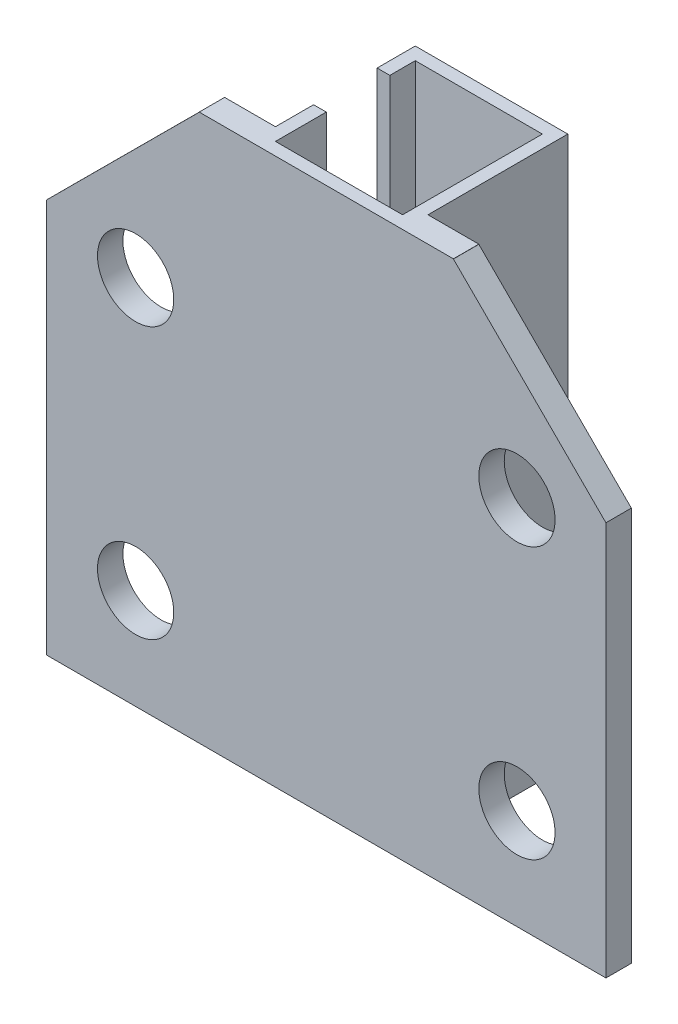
ISO-10303-21;
HEADER;
FILE_DESCRIPTION(('STEP AP214'),'2;1');
FILE_NAME('part.step','',(''),(''),'','','');
FILE_SCHEMA(('AUTOMOTIVE_DESIGN { 1 0 10303 214 1 1 1 1 }'));
ENDSEC;
DATA;
#1=APPLICATION_CONTEXT('core data for automotive mechanical design processes');
#2=APPLICATION_PROTOCOL_DEFINITION('international standard','automotive_design',2000,#1);
#3=PRODUCT_CONTEXT('',#1,'mechanical');
#4=PRODUCT('Part','Part','',(#3));
#5=PRODUCT_RELATED_PRODUCT_CATEGORY('part','',(#4));
#6=PRODUCT_DEFINITION_FORMATION('','',#4);
#7=PRODUCT_DEFINITION_CONTEXT('part definition',#1,'design');
#8=PRODUCT_DEFINITION('design','',#6,#7);
#9=PRODUCT_DEFINITION_SHAPE('','',#8);
#10=(LENGTH_UNIT() NAMED_UNIT(*) SI_UNIT(.MILLI.,.METRE.));
#11=(NAMED_UNIT(*) PLANE_ANGLE_UNIT() SI_UNIT($,.RADIAN.));
#12=(NAMED_UNIT(*) SI_UNIT($,.STERADIAN.) SOLID_ANGLE_UNIT());
#13=UNCERTAINTY_MEASURE_WITH_UNIT(LENGTH_MEASURE(1.E-05),#10,'distance_accuracy_value','');
#14=(GEOMETRIC_REPRESENTATION_CONTEXT(3) GLOBAL_UNCERTAINTY_ASSIGNED_CONTEXT((#13)) GLOBAL_UNIT_ASSIGNED_CONTEXT((#10,
#11,#12)) REPRESENTATION_CONTEXT('',''));
#15=CARTESIAN_POINT('',(0.,0.,0.));
#16=DIRECTION('',(0.,0.,1.));
#17=DIRECTION('',(1.,0.,0.));
#18=AXIS2_PLACEMENT_3D('',#15,#16,#17);
#19=CARTESIAN_POINT('',(-11.,21.5,-2.94888178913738));
#20=DIRECTION('',(0.,1.,0.));
#21=DIRECTION('',(0.,0.,1.));
#22=AXIS2_PLACEMENT_3D('',#19,#20,#21);
#23=PLANE('',#22);
#24=DIRECTION('',(-1.,0.,0.));
#25=VECTOR('',#24,1.);
#26=CARTESIAN_POINT('',(11.001,21.5,-5.44888178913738));
#27=LINE('',#26,#25);
#28=CARTESIAN_POINT('',(-2.5,21.5,-5.44888178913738));
#29=VERTEX_POINT('',#28);
#30=CARTESIAN_POINT('',(-3.,21.5,-5.44888178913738));
#31=VERTEX_POINT('',#30);
#32=EDGE_CURVE('E502',#29,#31,#27,.T.);
#33=ORIENTED_EDGE('',*,*,#32,.T.);
#34=DIRECTION('',(0.,0.,1.));
#35=VECTOR('',#34,1.);
#36=CARTESIAN_POINT('',(-3.,21.5,-3.94888178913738));
#37=LINE('',#36,#35);
#38=CARTESIAN_POINT('',(-3.,21.5,-3.94888178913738));
#39=VERTEX_POINT('',#38);
#40=EDGE_CURVE('E558',#31,#39,#37,.T.);
#41=ORIENTED_EDGE('',*,*,#40,.T.);
#42=DIRECTION('',(-1.,0.,0.));
#43=VECTOR('',#42,1.);
#44=CARTESIAN_POINT('',(-11.,21.5,-3.94888178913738));
#45=LINE('',#44,#43);
#46=CARTESIAN_POINT('',(-4.99966483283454,21.5,-3.94888178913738));
#47=VERTEX_POINT('',#46);
#48=EDGE_CURVE('E560',#39,#47,#45,.T.);
#49=ORIENTED_EDGE('',*,*,#48,.T.);
#50=DIRECTION('',(0.,0.,1.));
#51=VECTOR('',#50,1.);
#52=CARTESIAN_POINT('',(-4.99966483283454,21.5,-2.94888178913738));
#53=LINE('',#52,#51);
#54=CARTESIAN_POINT('',(-4.99966483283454,21.5,-2.94888178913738));
#55=VERTEX_POINT('',#54);
#56=EDGE_CURVE('E663',#47,#55,#53,.T.);
#57=ORIENTED_EDGE('',*,*,#56,.T.);
#58=DIRECTION('',(1.,0.,0.));
#59=VECTOR('',#58,1.);
#60=CARTESIAN_POINT('',(-11.,21.5,-2.94888178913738));
#61=LINE('',#60,#59);
#62=CARTESIAN_POINT('',(4.99966483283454,21.5,-2.94888178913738));
#63=VERTEX_POINT('',#62);
#64=EDGE_CURVE('E550',#55,#63,#61,.T.);
#65=ORIENTED_EDGE('',*,*,#64,.T.);
#66=DIRECTION('',(0.,0.,1.));
#67=VECTOR('',#66,1.);
#68=CARTESIAN_POINT('',(4.99966483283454,21.5,-2.94888178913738));
#69=LINE('',#68,#67);
#70=CARTESIAN_POINT('',(4.99966483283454,21.5,-3.94888178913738));
#71=VERTEX_POINT('',#70);
#72=EDGE_CURVE('E613',#71,#63,#69,.T.);
#73=ORIENTED_EDGE('',*,*,#72,.F.);
#74=DIRECTION('',(-1.,0.,0.));
#75=VECTOR('',#74,1.);
#76=CARTESIAN_POINT('',(11.,21.5,-3.94888178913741));
#77=LINE('',#76,#75);
#78=CARTESIAN_POINT('',(3.,21.5,-3.94888178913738));
#79=VERTEX_POINT('',#78);
#80=EDGE_CURVE('E552',#71,#79,#77,.T.);
#81=ORIENTED_EDGE('',*,*,#80,.T.);
#82=DIRECTION('',(0.,0.,-1.));
#83=VECTOR('',#82,1.);
#84=CARTESIAN_POINT('',(3.,21.5,-3.94888178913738));
#85=LINE('',#84,#83);
#86=CARTESIAN_POINT('',(3.,21.5,-9.44888178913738));
#87=VERTEX_POINT('',#86);
#88=EDGE_CURVE('E554',#79,#87,#85,.T.);
#89=ORIENTED_EDGE('',*,*,#88,.T.);
#90=DIRECTION('',(-1.,0.,0.));
#91=VECTOR('',#90,1.);
#92=CARTESIAN_POINT('',(3.,21.5,-9.44888178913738));
#93=LINE('',#92,#91);
#94=CARTESIAN_POINT('',(-3.,21.5,-9.44888178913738));
#95=VERTEX_POINT('',#94);
#96=EDGE_CURVE('E556',#87,#95,#93,.T.);
#97=ORIENTED_EDGE('',*,*,#96,.T.);
#98=CARTESIAN_POINT('',(-3.,21.5,-7.94888178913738));
#99=VERTEX_POINT('',#98);
#100=EDGE_CURVE('E501',#95,#99,#37,.T.);
#101=ORIENTED_EDGE('',*,*,#100,.T.);
#102=DIRECTION('',(1.,0.,0.));
#103=VECTOR('',#102,1.);
#104=CARTESIAN_POINT('',(11.001,21.5,-7.94888178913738));
#105=LINE('',#104,#103);
#106=CARTESIAN_POINT('',(-2.5,21.5,-7.94888178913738));
#107=VERTEX_POINT('',#106);
#108=EDGE_CURVE('E486',#99,#107,#105,.T.);
#109=ORIENTED_EDGE('',*,*,#108,.T.);
#110=DIRECTION('',(0.,0.,1.));
#111=VECTOR('',#110,1.);
#112=CARTESIAN_POINT('',(-2.5,21.5,-8.94888178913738));
#113=LINE('',#112,#111);
#114=CARTESIAN_POINT('',(-2.5,21.5,-8.94888178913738));
#115=VERTEX_POINT('',#114);
#116=EDGE_CURVE('E499',#115,#107,#113,.T.);
#117=ORIENTED_EDGE('',*,*,#116,.F.);
#118=DIRECTION('',(-1.,0.,0.));
#119=VECTOR('',#118,1.);
#120=CARTESIAN_POINT('',(-2.5,21.5,-8.94888178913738));
#121=LINE('',#120,#119);
#122=CARTESIAN_POINT('',(2.5,21.5,-8.94888178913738));
#123=VERTEX_POINT('',#122);
#124=EDGE_CURVE('E520',#123,#115,#121,.T.);
#125=ORIENTED_EDGE('',*,*,#124,.F.);
#126=DIRECTION('',(0.,0.,-1.));
#127=VECTOR('',#126,1.);
#128=CARTESIAN_POINT('',(2.5,21.5,-8.94888178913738));
#129=LINE('',#128,#127);
#130=CARTESIAN_POINT('',(2.5,21.5,-3.44888178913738));
#131=VERTEX_POINT('',#130);
#132=EDGE_CURVE('E512',#131,#123,#129,.T.);
#133=ORIENTED_EDGE('',*,*,#132,.F.);
#134=DIRECTION('',(1.,0.,0.));
#135=VECTOR('',#134,1.);
#136=CARTESIAN_POINT('',(-2.5,21.5,-3.44888178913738));
#137=LINE('',#136,#135);
#138=CARTESIAN_POINT('',(-2.5,21.5,-3.44888178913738));
#139=VERTEX_POINT('',#138);
#140=EDGE_CURVE('E509',#139,#131,#137,.T.);
#141=ORIENTED_EDGE('',*,*,#140,.F.);
#142=EDGE_CURVE('E510',#29,#139,#113,.T.);
#143=ORIENTED_EDGE('',*,*,#142,.F.);
#144=EDGE_LOOP('',(#33,#41,#49,#57,#65,#73,#81,#89,#97,#101,#109,#117,#125,#133,#141,#143));
#145=FACE_BOUND('',#144,.T.);
#146=ADVANCED_FACE('F349',(#145),#23,.T.);
#147=CARTESIAN_POINT('',(-11.,21.5,-2.94888178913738));
#148=DIRECTION('',(0.,0.,-1.));
#149=DIRECTION('',(-1.,0.,0.));
#150=AXIS2_PLACEMENT_3D('',#147,#148,#149);
#151=PLANE('',#150);
#152=CARTESIAN_POINT('',(-7.50000000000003,14.6078928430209,-2.94888178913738));
#153=DIRECTION('',(0.,0.,-1.));
#154=DIRECTION('',(-1.,0.,0.));
#155=AXIS2_PLACEMENT_3D('',#152,#153,#154);
#156=CIRCLE('',#155,1.5);
#157=CARTESIAN_POINT('',(-9.00000000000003,14.6078928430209,-2.94888178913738));
#158=VERTEX_POINT('',#157);
#159=EDGE_CURVE('E843',#158,#158,#156,.T.);
#160=ORIENTED_EDGE('',*,*,#159,.T.);
#161=EDGE_LOOP('',(#160));
#162=FACE_BOUND('',#161,.T.);
#163=CARTESIAN_POINT('',(7.5,14.6078928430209,-2.94888178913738));
#164=DIRECTION('',(0.,0.,-1.));
#165=DIRECTION('',(-1.,0.,0.));
#166=AXIS2_PLACEMENT_3D('',#163,#164,#165);
#167=CIRCLE('',#166,1.5);
#168=CARTESIAN_POINT('',(6.,14.6078928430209,-2.94888178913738));
#169=VERTEX_POINT('',#168);
#170=EDGE_CURVE('E853',#169,#169,#167,.T.);
#171=ORIENTED_EDGE('',*,*,#170,.T.);
#172=EDGE_LOOP('',(#171));
#173=FACE_BOUND('',#172,.T.);
#174=CARTESIAN_POINT('',(-7.5,3.94889284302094,-2.94888178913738));
#175=DIRECTION('',(0.,0.,-1.));
#176=DIRECTION('',(-1.,0.,0.));
#177=AXIS2_PLACEMENT_3D('',#174,#175,#176);
#178=CIRCLE('',#177,1.5);
#179=CARTESIAN_POINT('',(-9.,3.94889284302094,-2.94888178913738));
#180=VERTEX_POINT('',#179);
#181=EDGE_CURVE('E859',#180,#180,#178,.T.);
#182=ORIENTED_EDGE('',*,*,#181,.T.);
#183=EDGE_LOOP('',(#182));
#184=FACE_BOUND('',#183,.T.);
#185=CARTESIAN_POINT('',(7.5,3.94889284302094,-2.94888178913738));
#186=DIRECTION('',(0.,0.,-1.));
#187=DIRECTION('',(-1.,0.,0.));
#188=AXIS2_PLACEMENT_3D('',#185,#186,#187);
#189=CIRCLE('',#188,1.5);
#190=CARTESIAN_POINT('',(6.,3.94889284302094,-2.94888178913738));
#191=VERTEX_POINT('',#190);
#192=EDGE_CURVE('E648',#191,#191,#189,.T.);
#193=ORIENTED_EDGE('',*,*,#192,.T.);
#194=EDGE_LOOP('',(#193));
#195=FACE_BOUND('',#194,.T.);
#196=DIRECTION('',(0.0594599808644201,0.998230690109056,0.));
#197=VECTOR('',#196,1.);
#198=CARTESIAN_POINT('',(-5.,21.4943731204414,-2.94888178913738));
#199=LINE('',#198,#197);
#200=CARTESIAN_POINT('',(-5.,21.4943731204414,-2.94888178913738));
#201=VERTEX_POINT('',#200);
#202=EDGE_CURVE('E670',#201,#55,#199,.T.);
#203=ORIENTED_EDGE('',*,*,#202,.F.);
#204=DIRECTION('',(0.707911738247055,0.706300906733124,0.));
#205=VECTOR('',#204,1.);
#206=CARTESIAN_POINT('',(-5.,21.4943731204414,-2.94888178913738));
#207=LINE('',#206,#205);
#208=CARTESIAN_POINT('',(-11.,15.508025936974,-2.94888178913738));
#209=VERTEX_POINT('',#208);
#210=EDGE_CURVE('E881',#209,#201,#207,.T.);
#211=ORIENTED_EDGE('',*,*,#210,.F.);
#212=DIRECTION('',(0.,-1.,0.));
#213=VECTOR('',#212,1.);
#214=CARTESIAN_POINT('',(-11.,21.5,-2.94888178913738));
#215=LINE('',#214,#213);
#216=CARTESIAN_POINT('',(-11.,0.,-2.94888178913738));
#217=VERTEX_POINT('',#216);
#218=EDGE_CURVE('E581',#209,#217,#215,.T.);
#219=ORIENTED_EDGE('',*,*,#218,.T.);
#220=DIRECTION('',(1.,0.,0.));
#221=VECTOR('',#220,1.);
#222=CARTESIAN_POINT('',(-11.,0.,-2.94888178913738));
#223=LINE('',#222,#221);
#224=CARTESIAN_POINT('',(11.,0.,-2.94888178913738));
#225=VERTEX_POINT('',#224);
#226=EDGE_CURVE('E530',#217,#225,#223,.T.);
#227=ORIENTED_EDGE('',*,*,#226,.T.);
#228=DIRECTION('',(0.,-1.,0.));
#229=VECTOR('',#228,1.);
#230=CARTESIAN_POINT('',(11.,21.5,-2.94888178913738));
#231=LINE('',#230,#229);
#232=CARTESIAN_POINT('',(11.,15.508025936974,-2.94888178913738));
#233=VERTEX_POINT('',#232);
#234=EDGE_CURVE('E579',#233,#225,#231,.T.);
#235=ORIENTED_EDGE('',*,*,#234,.F.);
#236=DIRECTION('',(-0.707911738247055,0.706300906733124,0.));
#237=VECTOR('',#236,1.);
#238=CARTESIAN_POINT('',(5.,21.4943731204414,-2.94888178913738));
#239=LINE('',#238,#237);
#240=CARTESIAN_POINT('',(5.,21.4943731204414,-2.94888178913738));
#241=VERTEX_POINT('',#240);
#242=EDGE_CURVE('E673',#233,#241,#239,.T.);
#243=ORIENTED_EDGE('',*,*,#242,.T.);
#244=DIRECTION('',(-0.0594599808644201,0.998230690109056,0.));
#245=VECTOR('',#244,1.);
#246=CARTESIAN_POINT('',(5.,21.4943731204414,-2.94888178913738));
#247=LINE('',#246,#245);
#248=EDGE_CURVE('E672',#241,#63,#247,.T.);
#249=ORIENTED_EDGE('',*,*,#248,.T.);
#250=ORIENTED_EDGE('',*,*,#64,.F.);
#251=EDGE_LOOP('',(#203,#211,#219,#227,#235,#243,#249,#250));
#252=FACE_BOUND('',#251,.T.);
#253=ADVANCED_FACE('F351',(#162,#173,#184,#195,#252),#151,.F.);
#254=CARTESIAN_POINT('',(-11.,21.5,-3.94888178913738));
#255=DIRECTION('',(0.,0.,1.));
#256=DIRECTION('',(1.,0.,0.));
#257=AXIS2_PLACEMENT_3D('',#254,#255,#256);
#258=PLANE('',#257);
#259=CARTESIAN_POINT('',(-7.50000000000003,14.6078928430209,-3.94888178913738));
#260=DIRECTION('',(0.,0.,-1.));
#261=DIRECTION('',(-1.,0.,0.));
#262=AXIS2_PLACEMENT_3D('',#259,#260,#261);
#263=CIRCLE('',#262,1.5);
#264=CARTESIAN_POINT('',(-9.00000000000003,14.6078928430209,-3.94888178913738));
#265=VERTEX_POINT('',#264);
#266=EDGE_CURVE('E846',#265,#265,#263,.T.);
#267=ORIENTED_EDGE('',*,*,#266,.F.);
#268=EDGE_LOOP('',(#267));
#269=FACE_BOUND('',#268,.T.);
#270=CARTESIAN_POINT('',(-7.5,3.94889284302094,-3.94888178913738));
#271=DIRECTION('',(0.,0.,-1.));
#272=DIRECTION('',(-1.,0.,0.));
#273=AXIS2_PLACEMENT_3D('',#270,#271,#272);
#274=CIRCLE('',#273,1.5);
#275=CARTESIAN_POINT('',(-9.,3.94889284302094,-3.94888178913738));
#276=VERTEX_POINT('',#275);
#277=EDGE_CURVE('E856',#276,#276,#274,.T.);
#278=ORIENTED_EDGE('',*,*,#277,.F.);
#279=EDGE_LOOP('',(#278));
#280=FACE_BOUND('',#279,.T.);
#281=DIRECTION('',(0.0594599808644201,0.998230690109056,0.));
#282=VECTOR('',#281,1.);
#283=CARTESIAN_POINT('',(-5.,21.4943731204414,-3.94888178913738));
#284=LINE('',#283,#282);
#285=CARTESIAN_POINT('',(-5.,21.4943731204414,-3.94888178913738));
#286=VERTEX_POINT('',#285);
#287=EDGE_CURVE('E662',#286,#47,#284,.T.);
#288=ORIENTED_EDGE('',*,*,#287,.T.);
#289=ORIENTED_EDGE('',*,*,#48,.F.);
#290=DIRECTION('',(0.,-1.,0.));
#291=VECTOR('',#290,1.);
#292=CARTESIAN_POINT('',(-3.,21.5,-3.94888178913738));
#293=LINE('',#292,#291);
#294=CARTESIAN_POINT('',(-3.,0.,-3.94888178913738));
#295=VERTEX_POINT('',#294);
#296=EDGE_CURVE('E565',#39,#295,#293,.T.);
#297=ORIENTED_EDGE('',*,*,#296,.T.);
#298=DIRECTION('',(-1.,0.,0.));
#299=VECTOR('',#298,1.);
#300=CARTESIAN_POINT('',(-11.,0.,-3.94888178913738));
#301=LINE('',#300,#299);
#302=CARTESIAN_POINT('',(-11.,0.,-3.94888178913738));
#303=VERTEX_POINT('',#302);
#304=EDGE_CURVE('E544',#295,#303,#301,.T.);
#305=ORIENTED_EDGE('',*,*,#304,.T.);
#306=DIRECTION('',(0.,-1.,0.));
#307=VECTOR('',#306,1.);
#308=CARTESIAN_POINT('',(-11.,21.5,-3.94888178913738));
#309=LINE('',#308,#307);
#310=CARTESIAN_POINT('',(-11.,15.508025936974,-3.94888178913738));
#311=VERTEX_POINT('',#310);
#312=EDGE_CURVE('E563',#311,#303,#309,.T.);
#313=ORIENTED_EDGE('',*,*,#312,.F.);
#314=DIRECTION('',(0.707911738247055,0.706300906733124,0.));
#315=VECTOR('',#314,1.);
#316=CARTESIAN_POINT('',(-5.,21.4943731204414,-3.94888178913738));
#317=LINE('',#316,#315);
#318=EDGE_CURVE('E371',#311,#286,#317,.T.);
#319=ORIENTED_EDGE('',*,*,#318,.T.);
#320=EDGE_LOOP('',(#288,#289,#297,#305,#313,#319));
#321=FACE_BOUND('',#320,.T.);
#322=ADVANCED_FACE('F660',(#269,#280,#321),#258,.F.);
#323=CARTESIAN_POINT('',(-11.,21.5,-3.44888178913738));
#324=DIRECTION('',(1.,0.,0.));
#325=DIRECTION('',(0.,0.,-1.));
#326=AXIS2_PLACEMENT_3D('',#323,#324,#325);
#327=PLANE('',#326);
#328=DIRECTION('',(0.,0.,1.));
#329=VECTOR('',#328,1.);
#330=CARTESIAN_POINT('',(-11.,15.508025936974,-3.44888178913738));
#331=LINE('',#330,#329);
#332=EDGE_CURVE('E11',#311,#209,#331,.T.);
#333=ORIENTED_EDGE('',*,*,#332,.F.);
#334=ORIENTED_EDGE('',*,*,#312,.T.);
#335=DIRECTION('',(0.,0.,1.));
#336=VECTOR('',#335,1.);
#337=CARTESIAN_POINT('',(-11.,0.,-3.44888178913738));
#338=LINE('',#337,#336);
#339=EDGE_CURVE('E547',#303,#217,#338,.T.);
#340=ORIENTED_EDGE('',*,*,#339,.T.);
#341=ORIENTED_EDGE('',*,*,#218,.F.);
#342=EDGE_LOOP('',(#333,#334,#340,#341));
#343=FACE_BOUND('',#342,.T.);
#344=ADVANCED_FACE('F701',(#343),#327,.F.);
#345=CARTESIAN_POINT('',(-11.,0.,-2.94888178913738));
#346=DIRECTION('',(0.,1.,0.));
#347=DIRECTION('',(0.,0.,1.));
#348=AXIS2_PLACEMENT_3D('',#345,#346,#347);
#349=PLANE('',#348);
#350=ORIENTED_EDGE('',*,*,#226,.F.);
#351=ORIENTED_EDGE('',*,*,#339,.F.);
#352=ORIENTED_EDGE('',*,*,#304,.F.);
#353=DIRECTION('',(0.,0.,1.));
#354=VECTOR('',#353,1.);
#355=CARTESIAN_POINT('',(-3.,0.,-3.94888178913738));
#356=LINE('',#355,#354);
#357=CARTESIAN_POINT('',(-3.,0.,-9.44888178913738));
#358=VERTEX_POINT('',#357);
#359=EDGE_CURVE('E542',#358,#295,#356,.T.);
#360=ORIENTED_EDGE('',*,*,#359,.F.);
#361=DIRECTION('',(-1.,0.,0.));
#362=VECTOR('',#361,1.);
#363=CARTESIAN_POINT('',(3.,0.,-9.44888178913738));
#364=LINE('',#363,#362);
#365=CARTESIAN_POINT('',(3.,0.,-9.44888178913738));
#366=VERTEX_POINT('',#365);
#367=EDGE_CURVE('E540',#366,#358,#364,.T.);
#368=ORIENTED_EDGE('',*,*,#367,.F.);
#369=DIRECTION('',(0.,0.,-1.));
#370=VECTOR('',#369,1.);
#371=CARTESIAN_POINT('',(3.,0.,-3.94888178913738));
#372=LINE('',#371,#370);
#373=CARTESIAN_POINT('',(3.,0.,-3.94888178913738));
#374=VERTEX_POINT('',#373);
#375=EDGE_CURVE('E538',#374,#366,#372,.T.);
#376=ORIENTED_EDGE('',*,*,#375,.F.);
#377=DIRECTION('',(-1.,0.,0.));
#378=VECTOR('',#377,1.);
#379=CARTESIAN_POINT('',(11.,0.,-3.94888178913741));
#380=LINE('',#379,#378);
#381=CARTESIAN_POINT('',(11.,0.,-3.94888178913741));
#382=VERTEX_POINT('',#381);
#383=EDGE_CURVE('E536',#382,#374,#380,.T.);
#384=ORIENTED_EDGE('',*,*,#383,.F.);
#385=DIRECTION('',(0.,0.,-1.));
#386=VECTOR('',#385,1.);
#387=CARTESIAN_POINT('',(11.,0.,-3.44888178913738));
#388=LINE('',#387,#386);
#389=EDGE_CURVE('E533',#225,#382,#388,.T.);
#390=ORIENTED_EDGE('',*,*,#389,.F.);
#391=EDGE_LOOP('',(#350,#351,#352,#360,#368,#376,#384,#390));
#392=FACE_BOUND('',#391,.T.);
#393=DIRECTION('',(0.,0.,1.));
#394=VECTOR('',#393,1.);
#395=CARTESIAN_POINT('',(-2.5,0.,-8.94888178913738));
#396=LINE('',#395,#394);
#397=CARTESIAN_POINT('',(-2.5,0.,-8.94888178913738));
#398=VERTEX_POINT('',#397);
#399=CARTESIAN_POINT('',(-2.5,0.,-3.44888178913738));
#400=VERTEX_POINT('',#399);
#401=EDGE_CURVE('E619',#398,#400,#396,.T.);
#402=ORIENTED_EDGE('',*,*,#401,.T.);
#403=DIRECTION('',(1.,0.,0.));
#404=VECTOR('',#403,1.);
#405=CARTESIAN_POINT('',(-2.5,0.,-3.44888178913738));
#406=LINE('',#405,#404);
#407=CARTESIAN_POINT('',(2.5,0.,-3.44888178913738));
#408=VERTEX_POINT('',#407);
#409=EDGE_CURVE('E622',#400,#408,#406,.T.);
#410=ORIENTED_EDGE('',*,*,#409,.T.);
#411=DIRECTION('',(0.,0.,-1.));
#412=VECTOR('',#411,1.);
#413=CARTESIAN_POINT('',(2.5,0.,-8.94888178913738));
#414=LINE('',#413,#412);
#415=CARTESIAN_POINT('',(2.5,0.,-8.94888178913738));
#416=VERTEX_POINT('',#415);
#417=EDGE_CURVE('E629',#408,#416,#414,.T.);
#418=ORIENTED_EDGE('',*,*,#417,.T.);
#419=DIRECTION('',(-1.,0.,0.));
#420=VECTOR('',#419,1.);
#421=CARTESIAN_POINT('',(-2.5,0.,-8.94888178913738));
#422=LINE('',#421,#420);
#423=EDGE_CURVE('E514',#416,#398,#422,.T.);
#424=ORIENTED_EDGE('',*,*,#423,.T.);
#425=EDGE_LOOP('',(#402,#410,#418,#424));
#426=FACE_BOUND('',#425,.T.);
#427=ADVANCED_FACE('F601',(#392,#426),#349,.F.);
#428=CARTESIAN_POINT('',(11.,21.5,-3.44888178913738));
#429=DIRECTION('',(-1.,0.,0.));
#430=DIRECTION('',(0.,0.,1.));
#431=AXIS2_PLACEMENT_3D('',#428,#429,#430);
#432=PLANE('',#431);
#433=DIRECTION('',(0.,-1.,0.));
#434=VECTOR('',#433,1.);
#435=CARTESIAN_POINT('',(11.,21.5,-3.94888178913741));
#436=LINE('',#435,#434);
#437=CARTESIAN_POINT('',(11.,15.508025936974,-3.94888178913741));
#438=VERTEX_POINT('',#437);
#439=EDGE_CURVE('E577',#438,#382,#436,.T.);
#440=ORIENTED_EDGE('',*,*,#439,.F.);
#441=DIRECTION('',(0.,0.,1.));
#442=VECTOR('',#441,1.);
#443=CARTESIAN_POINT('',(11.,15.508025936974,-3.44888178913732));
#444=LINE('',#443,#442);
#445=EDGE_CURVE('E594',#438,#233,#444,.T.);
#446=ORIENTED_EDGE('',*,*,#445,.T.);
#447=ORIENTED_EDGE('',*,*,#234,.T.);
#448=ORIENTED_EDGE('',*,*,#389,.T.);
#449=EDGE_LOOP('',(#440,#446,#447,#448));
#450=FACE_BOUND('',#449,.T.);
#451=ADVANCED_FACE('F593',(#450),#432,.F.);
#452=CARTESIAN_POINT('',(11.,21.5,-3.94888178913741));
#453=DIRECTION('',(0.,0.,1.));
#454=DIRECTION('',(1.,0.,0.));
#455=AXIS2_PLACEMENT_3D('',#452,#453,#454);
#456=PLANE('',#455);
#457=CARTESIAN_POINT('',(7.5,14.6078928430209,-3.94888178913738));
#458=DIRECTION('',(0.,0.,-1.));
#459=DIRECTION('',(-1.,0.,0.));
#460=AXIS2_PLACEMENT_3D('',#457,#458,#459);
#461=CIRCLE('',#460,1.5);
#462=CARTESIAN_POINT('',(6.,14.6078928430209,-3.94888178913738));
#463=VERTEX_POINT('',#462);
#464=EDGE_CURVE('E848',#463,#463,#461,.T.);
#465=ORIENTED_EDGE('',*,*,#464,.F.);
#466=EDGE_LOOP('',(#465));
#467=FACE_BOUND('',#466,.T.);
#468=CARTESIAN_POINT('',(7.5,3.94889284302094,-3.94888178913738));
#469=DIRECTION('',(0.,0.,-1.));
#470=DIRECTION('',(-1.,0.,0.));
#471=AXIS2_PLACEMENT_3D('',#468,#469,#470);
#472=CIRCLE('',#471,1.5);
#473=CARTESIAN_POINT('',(6.,3.94889284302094,-3.94888178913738));
#474=VERTEX_POINT('',#473);
#475=EDGE_CURVE('E862',#474,#474,#472,.T.);
#476=ORIENTED_EDGE('',*,*,#475,.F.);
#477=EDGE_LOOP('',(#476));
#478=FACE_BOUND('',#477,.T.);
#479=ORIENTED_EDGE('',*,*,#80,.F.);
#480=DIRECTION('',(-0.0594599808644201,0.998230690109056,0.));
#481=VECTOR('',#480,1.);
#482=CARTESIAN_POINT('',(5.,21.4943731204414,-3.94888178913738));
#483=LINE('',#482,#481);
#484=CARTESIAN_POINT('',(5.,21.4943731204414,-3.94888178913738));
#485=VERTEX_POINT('',#484);
#486=EDGE_CURVE('E588',#485,#71,#483,.T.);
#487=ORIENTED_EDGE('',*,*,#486,.F.);
#488=DIRECTION('',(0.707911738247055,-0.706300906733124,0.));
#489=VECTOR('',#488,1.);
#490=CARTESIAN_POINT('',(8.00402074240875,18.4971879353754,-3.9488817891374));
#491=LINE('',#490,#489);
#492=EDGE_CURVE('E357',#485,#438,#491,.T.);
#493=ORIENTED_EDGE('',*,*,#492,.T.);
#494=ORIENTED_EDGE('',*,*,#439,.T.);
#495=ORIENTED_EDGE('',*,*,#383,.T.);
#496=DIRECTION('',(0.,-1.,0.));
#497=VECTOR('',#496,1.);
#498=CARTESIAN_POINT('',(3.,21.5,-3.94888178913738));
#499=LINE('',#498,#497);
#500=EDGE_CURVE('E574',#79,#374,#499,.T.);
#501=ORIENTED_EDGE('',*,*,#500,.F.);
#502=EDGE_LOOP('',(#479,#487,#493,#494,#495,#501));
#503=FACE_BOUND('',#502,.T.);
#504=ADVANCED_FACE('F587',(#467,#478,#503),#456,.F.);
#505=CARTESIAN_POINT('',(3.,21.5,-3.94888178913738));
#506=DIRECTION('',(-1.,0.,0.));
#507=DIRECTION('',(0.,0.,1.));
#508=AXIS2_PLACEMENT_3D('',#505,#506,#507);
#509=PLANE('',#508);
#510=ORIENTED_EDGE('',*,*,#375,.T.);
#511=DIRECTION('',(0.,-1.,0.));
#512=VECTOR('',#511,1.);
#513=CARTESIAN_POINT('',(3.,21.5,-9.44888178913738));
#514=LINE('',#513,#512);
#515=EDGE_CURVE('E571',#87,#366,#514,.T.);
#516=ORIENTED_EDGE('',*,*,#515,.F.);
#517=ORIENTED_EDGE('',*,*,#88,.F.);
#518=ORIENTED_EDGE('',*,*,#500,.T.);
#519=EDGE_LOOP('',(#510,#516,#517,#518));
#520=FACE_BOUND('',#519,.T.);
#521=ADVANCED_FACE('F607',(#520),#509,.F.);
#522=CARTESIAN_POINT('',(3.,21.5,-9.44888178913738));
#523=DIRECTION('',(0.,0.,1.));
#524=DIRECTION('',(1.,0.,0.));
#525=AXIS2_PLACEMENT_3D('',#522,#523,#524);
#526=PLANE('',#525);
#527=ORIENTED_EDGE('',*,*,#367,.T.);
#528=DIRECTION('',(0.,-1.,0.));
#529=VECTOR('',#528,1.);
#530=CARTESIAN_POINT('',(-3.,21.5,-9.44888178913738));
#531=LINE('',#530,#529);
#532=EDGE_CURVE('E568',#95,#358,#531,.T.);
#533=ORIENTED_EDGE('',*,*,#532,.F.);
#534=ORIENTED_EDGE('',*,*,#96,.F.);
#535=ORIENTED_EDGE('',*,*,#515,.T.);
#536=EDGE_LOOP('',(#527,#533,#534,#535));
#537=FACE_BOUND('',#536,.T.);
#538=ADVANCED_FACE('F709',(#537),#526,.F.);
#539=CARTESIAN_POINT('',(-3.,21.5,-3.94888178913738));
#540=DIRECTION('',(1.,0.,0.));
#541=DIRECTION('',(0.,0.,-1.));
#542=AXIS2_PLACEMENT_3D('',#539,#540,#541);
#543=PLANE('',#542);
#544=ORIENTED_EDGE('',*,*,#40,.F.);
#545=DIRECTION('',(0.,1.,0.));
#546=VECTOR('',#545,1.);
#547=CARTESIAN_POINT('',(-3.,22.2746716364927,-5.44888178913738));
#548=LINE('',#547,#546);
#549=CARTESIAN_POINT('',(-3.,7.5,-5.44888178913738));
#550=VERTEX_POINT('',#549);
#551=EDGE_CURVE('E654',#550,#31,#548,.T.);
#552=ORIENTED_EDGE('',*,*,#551,.F.);
#553=CARTESIAN_POINT('',(-3.,7.5,-6.69888178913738));
#554=DIRECTION('',(-1.,0.,0.));
#555=DIRECTION('',(0.,0.,1.));
#556=AXIS2_PLACEMENT_3D('',#553,#554,#555);
#557=CIRCLE('',#556,1.25);
#558=CARTESIAN_POINT('',(-3.,7.5,-7.94888178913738));
#559=VERTEX_POINT('',#558);
#560=EDGE_CURVE('E869',#559,#550,#557,.T.);
#561=ORIENTED_EDGE('',*,*,#560,.F.);
#562=DIRECTION('',(0.,-1.,0.));
#563=VECTOR('',#562,1.);
#564=CARTESIAN_POINT('',(-3.,22.2746716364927,-7.94888178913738));
#565=LINE('',#564,#563);
#566=EDGE_CURVE('E491',#99,#559,#565,.T.);
#567=ORIENTED_EDGE('',*,*,#566,.F.);
#568=ORIENTED_EDGE('',*,*,#100,.F.);
#569=ORIENTED_EDGE('',*,*,#532,.T.);
#570=ORIENTED_EDGE('',*,*,#359,.T.);
#571=ORIENTED_EDGE('',*,*,#296,.F.);
#572=EDGE_LOOP('',(#544,#552,#561,#567,#568,#569,#570,#571));
#573=FACE_BOUND('',#572,.T.);
#574=ADVANCED_FACE('F652',(#573),#543,.F.);
#575=CARTESIAN_POINT('',(-2.5,21.5,-8.94888178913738));
#576=DIRECTION('',(1.,0.,0.));
#577=DIRECTION('',(0.,0.,-1.));
#578=AXIS2_PLACEMENT_3D('',#575,#576,#577);
#579=PLANE('',#578);
#580=DIRECTION('',(0.,1.,0.));
#581=VECTOR('',#580,1.);
#582=CARTESIAN_POINT('',(-2.5,22.2746716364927,-5.44888178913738));
#583=LINE('',#582,#581);
#584=CARTESIAN_POINT('',(-2.5,7.5,-5.44888178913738));
#585=VERTEX_POINT('',#584);
#586=EDGE_CURVE('E492',#585,#29,#583,.T.);
#587=ORIENTED_EDGE('',*,*,#586,.T.);
#588=ORIENTED_EDGE('',*,*,#142,.T.);
#589=DIRECTION('',(0.,-1.,0.));
#590=VECTOR('',#589,1.);
#591=CARTESIAN_POINT('',(-2.5,21.5,-3.44888178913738));
#592=LINE('',#591,#590);
#593=EDGE_CURVE('E527',#139,#400,#592,.T.);
#594=ORIENTED_EDGE('',*,*,#593,.T.);
#595=ORIENTED_EDGE('',*,*,#401,.F.);
#596=DIRECTION('',(0.,-1.,0.));
#597=VECTOR('',#596,1.);
#598=CARTESIAN_POINT('',(-2.5,21.5,-8.94888178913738));
#599=LINE('',#598,#597);
#600=EDGE_CURVE('E508',#115,#398,#599,.T.);
#601=ORIENTED_EDGE('',*,*,#600,.F.);
#602=ORIENTED_EDGE('',*,*,#116,.T.);
#603=DIRECTION('',(0.,-1.,0.));
#604=VECTOR('',#603,1.);
#605=CARTESIAN_POINT('',(-2.5,22.2746716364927,-7.94888178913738));
#606=LINE('',#605,#604);
#607=CARTESIAN_POINT('',(-2.5,7.5,-7.94888178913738));
#608=VERTEX_POINT('',#607);
#609=EDGE_CURVE('E483',#107,#608,#606,.T.);
#610=ORIENTED_EDGE('',*,*,#609,.T.);
#611=CARTESIAN_POINT('',(-2.5,7.5,-6.69888178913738));
#612=DIRECTION('',(1.,0.,0.));
#613=DIRECTION('',(0.,0.,-1.));
#614=AXIS2_PLACEMENT_3D('',#611,#612,#613);
#615=CIRCLE('',#614,1.25);
#616=EDGE_CURVE('E875',#608,#585,#615,.F.);
#617=ORIENTED_EDGE('',*,*,#616,.T.);
#618=EDGE_LOOP('',(#587,#588,#594,#595,#601,#602,#610,#617));
#619=FACE_BOUND('',#618,.T.);
#620=ADVANCED_FACE('F506',(#619),#579,.T.);
#621=CARTESIAN_POINT('',(-2.5,21.5,-3.44888178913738));
#622=DIRECTION('',(0.,0.,-1.));
#623=DIRECTION('',(-1.,0.,0.));
#624=AXIS2_PLACEMENT_3D('',#621,#622,#623);
#625=PLANE('',#624);
#626=ORIENTED_EDGE('',*,*,#409,.F.);
#627=ORIENTED_EDGE('',*,*,#593,.F.);
#628=ORIENTED_EDGE('',*,*,#140,.T.);
#629=DIRECTION('',(0.,-1.,0.));
#630=VECTOR('',#629,1.);
#631=CARTESIAN_POINT('',(2.5,21.5,-3.44888178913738));
#632=LINE('',#631,#630);
#633=EDGE_CURVE('E525',#131,#408,#632,.T.);
#634=ORIENTED_EDGE('',*,*,#633,.T.);
#635=EDGE_LOOP('',(#626,#627,#628,#634));
#636=FACE_BOUND('',#635,.T.);
#637=ADVANCED_FACE('F643',(#636),#625,.T.);
#638=CARTESIAN_POINT('',(2.5,21.5,-8.94888178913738));
#639=DIRECTION('',(-1.,0.,0.));
#640=DIRECTION('',(0.,0.,1.));
#641=AXIS2_PLACEMENT_3D('',#638,#639,#640);
#642=PLANE('',#641);
#643=ORIENTED_EDGE('',*,*,#417,.F.);
#644=ORIENTED_EDGE('',*,*,#633,.F.);
#645=ORIENTED_EDGE('',*,*,#132,.T.);
#646=DIRECTION('',(0.,-1.,0.));
#647=VECTOR('',#646,1.);
#648=CARTESIAN_POINT('',(2.5,21.5,-8.94888178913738));
#649=LINE('',#648,#647);
#650=EDGE_CURVE('E523',#123,#416,#649,.T.);
#651=ORIENTED_EDGE('',*,*,#650,.T.);
#652=EDGE_LOOP('',(#643,#644,#645,#651));
#653=FACE_BOUND('',#652,.T.);
#654=ADVANCED_FACE('F641',(#653),#642,.T.);
#655=CARTESIAN_POINT('',(-2.5,21.5,-8.94888178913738));
#656=DIRECTION('',(0.,0.,1.));
#657=DIRECTION('',(1.,0.,0.));
#658=AXIS2_PLACEMENT_3D('',#655,#656,#657);
#659=PLANE('',#658);
#660=ORIENTED_EDGE('',*,*,#423,.F.);
#661=ORIENTED_EDGE('',*,*,#650,.F.);
#662=ORIENTED_EDGE('',*,*,#124,.T.);
#663=ORIENTED_EDGE('',*,*,#600,.T.);
#664=EDGE_LOOP('',(#660,#661,#662,#663));
#665=FACE_BOUND('',#664,.T.);
#666=ADVANCED_FACE('F635',(#665),#659,.T.);
#667=CARTESIAN_POINT('',(5.,21.4943731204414,-2.94888178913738));
#668=DIRECTION('',(-0.706300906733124,-0.707911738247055,0.));
#669=DIRECTION('',(0.707911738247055,-0.706300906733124,0.));
#670=AXIS2_PLACEMENT_3D('',#667,#668,#669);
#671=PLANE('',#670);
#672=ORIENTED_EDGE('',*,*,#492,.F.);
#673=DIRECTION('',(0.,0.,-1.));
#674=VECTOR('',#673,1.);
#675=CARTESIAN_POINT('',(5.,21.4943731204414,-2.94888178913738));
#676=LINE('',#675,#674);
#677=EDGE_CURVE('E624',#241,#485,#676,.T.);
#678=ORIENTED_EDGE('',*,*,#677,.F.);
#679=ORIENTED_EDGE('',*,*,#242,.F.);
#680=ORIENTED_EDGE('',*,*,#445,.F.);
#681=EDGE_LOOP('',(#672,#678,#679,#680));
#682=FACE_BOUND('',#681,.T.);
#683=ADVANCED_FACE('F678',(#682),#671,.F.);
#684=CARTESIAN_POINT('',(5.,21.4943731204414,-2.94888178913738));
#685=DIRECTION('',(-0.998230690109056,-0.0594599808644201,0.));
#686=DIRECTION('',(0.0594599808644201,-0.998230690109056,0.));
#687=AXIS2_PLACEMENT_3D('',#684,#685,#686);
#688=PLANE('',#687);
#689=ORIENTED_EDGE('',*,*,#72,.T.);
#690=ORIENTED_EDGE('',*,*,#248,.F.);
#691=ORIENTED_EDGE('',*,*,#677,.T.);
#692=ORIENTED_EDGE('',*,*,#486,.T.);
#693=EDGE_LOOP('',(#689,#690,#691,#692));
#694=FACE_BOUND('',#693,.T.);
#695=ADVANCED_FACE('F677',(#694),#688,.F.);
#696=CARTESIAN_POINT('',(-5.,21.4943731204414,-2.94888178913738));
#697=DIRECTION('',(-0.706300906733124,0.707911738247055,0.));
#698=DIRECTION('',(-0.707911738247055,-0.706300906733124,0.));
#699=AXIS2_PLACEMENT_3D('',#696,#697,#698);
#700=PLANE('',#699);
#701=ORIENTED_EDGE('',*,*,#332,.T.);
#702=ORIENTED_EDGE('',*,*,#210,.T.);
#703=DIRECTION('',(0.,0.,-1.));
#704=VECTOR('',#703,1.);
#705=CARTESIAN_POINT('',(-5.,21.4943731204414,-2.94888178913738));
#706=LINE('',#705,#704);
#707=EDGE_CURVE('E665',#201,#286,#706,.T.);
#708=ORIENTED_EDGE('',*,*,#707,.T.);
#709=ORIENTED_EDGE('',*,*,#318,.F.);
#710=EDGE_LOOP('',(#701,#702,#708,#709));
#711=FACE_BOUND('',#710,.T.);
#712=ADVANCED_FACE('F685',(#711),#700,.T.);
#713=CARTESIAN_POINT('',(-5.,21.4943731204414,-2.94888178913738));
#714=DIRECTION('',(-0.998230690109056,0.0594599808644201,0.));
#715=DIRECTION('',(-0.0594599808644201,-0.998230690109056,0.));
#716=AXIS2_PLACEMENT_3D('',#713,#714,#715);
#717=PLANE('',#716);
#718=ORIENTED_EDGE('',*,*,#287,.F.);
#719=ORIENTED_EDGE('',*,*,#707,.F.);
#720=ORIENTED_EDGE('',*,*,#202,.T.);
#721=ORIENTED_EDGE('',*,*,#56,.F.);
#722=EDGE_LOOP('',(#718,#719,#720,#721));
#723=FACE_BOUND('',#722,.T.);
#724=ADVANCED_FACE('F781',(#723),#717,.T.);
#725=CARTESIAN_POINT('',(11.001,7.5,-6.69888178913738));
#726=DIRECTION('',(-1.,0.,0.));
#727=DIRECTION('',(0.,0.,1.));
#728=AXIS2_PLACEMENT_3D('',#725,#726,#727);
#729=CYLINDRICAL_SURFACE('',#728,1.25);
#730=DIRECTION('',(-1.,0.,0.));
#731=VECTOR('',#730,1.);
#732=CARTESIAN_POINT('',(11.001,7.5,-7.94888178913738));
#733=LINE('',#732,#731);
#734=EDGE_CURVE('E364',#608,#559,#733,.T.);
#735=ORIENTED_EDGE('',*,*,#734,.T.);
#736=ORIENTED_EDGE('',*,*,#560,.T.);
#737=DIRECTION('',(-1.,0.,0.));
#738=VECTOR('',#737,1.);
#739=CARTESIAN_POINT('',(11.001,7.5,-5.44888178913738));
#740=LINE('',#739,#738);
#741=EDGE_CURVE('E873',#585,#550,#740,.T.);
#742=ORIENTED_EDGE('',*,*,#741,.F.);
#743=ORIENTED_EDGE('',*,*,#616,.F.);
#744=EDGE_LOOP('',(#735,#736,#742,#743));
#745=FACE_BOUND('',#744,.T.);
#746=ADVANCED_FACE('F787',(#745),#729,.F.);
#747=CARTESIAN_POINT('',(11.001,22.2746716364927,-5.44888178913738));
#748=DIRECTION('',(0.,0.,1.));
#749=DIRECTION('',(0.,-1.,0.));
#750=AXIS2_PLACEMENT_3D('',#747,#748,#749);
#751=PLANE('',#750);
#752=ORIENTED_EDGE('',*,*,#586,.F.);
#753=ORIENTED_EDGE('',*,*,#741,.T.);
#754=ORIENTED_EDGE('',*,*,#551,.T.);
#755=ORIENTED_EDGE('',*,*,#32,.F.);
#756=EDGE_LOOP('',(#752,#753,#754,#755));
#757=FACE_BOUND('',#756,.T.);
#758=ADVANCED_FACE('F793',(#757),#751,.F.);
#759=CARTESIAN_POINT('',(11.001,22.2746716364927,-7.94888178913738));
#760=DIRECTION('',(0.,0.,-1.));
#761=DIRECTION('',(-1.,0.,0.));
#762=AXIS2_PLACEMENT_3D('',#759,#760,#761);
#763=PLANE('',#762);
#764=ORIENTED_EDGE('',*,*,#566,.T.);
#765=ORIENTED_EDGE('',*,*,#734,.F.);
#766=ORIENTED_EDGE('',*,*,#609,.F.);
#767=ORIENTED_EDGE('',*,*,#108,.F.);
#768=EDGE_LOOP('',(#764,#765,#766,#767));
#769=FACE_BOUND('',#768,.T.);
#770=ADVANCED_FACE('F485',(#769),#763,.F.);
#771=CARTESIAN_POINT('',(7.5,3.94889284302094,-2.94888178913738));
#772=DIRECTION('',(0.,0.,-1.));
#773=DIRECTION('',(-1.,0.,0.));
#774=AXIS2_PLACEMENT_3D('',#771,#772,#773);
#775=CYLINDRICAL_SURFACE('',#774,1.5);
#776=ORIENTED_EDGE('',*,*,#192,.F.);
#777=EDGE_LOOP('',(#776));
#778=FACE_BOUND('',#777,.T.);
#779=ORIENTED_EDGE('',*,*,#475,.T.);
#780=EDGE_LOOP('',(#779));
#781=FACE_BOUND('',#780,.T.);
#782=ADVANCED_FACE('F807',(#778,#781),#775,.F.);
#783=CARTESIAN_POINT('',(-7.5,3.94889284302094,-2.94888178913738));
#784=DIRECTION('',(0.,0.,-1.));
#785=DIRECTION('',(-1.,0.,0.));
#786=AXIS2_PLACEMENT_3D('',#783,#784,#785);
#787=CYLINDRICAL_SURFACE('',#786,1.5);
#788=ORIENTED_EDGE('',*,*,#181,.F.);
#789=EDGE_LOOP('',(#788));
#790=FACE_BOUND('',#789,.T.);
#791=ORIENTED_EDGE('',*,*,#277,.T.);
#792=EDGE_LOOP('',(#791));
#793=FACE_BOUND('',#792,.T.);
#794=ADVANCED_FACE('F814',(#790,#793),#787,.F.);
#795=CARTESIAN_POINT('',(7.5,14.6078928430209,-2.94888178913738));
#796=DIRECTION('',(0.,0.,-1.));
#797=DIRECTION('',(-1.,0.,0.));
#798=AXIS2_PLACEMENT_3D('',#795,#796,#797);
#799=CYLINDRICAL_SURFACE('',#798,1.5);
#800=ORIENTED_EDGE('',*,*,#170,.F.);
#801=EDGE_LOOP('',(#800));
#802=FACE_BOUND('',#801,.T.);
#803=ORIENTED_EDGE('',*,*,#464,.T.);
#804=EDGE_LOOP('',(#803));
#805=FACE_BOUND('',#804,.T.);
#806=ADVANCED_FACE('F822',(#802,#805),#799,.F.);
#807=CARTESIAN_POINT('',(-7.50000000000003,14.6078928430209,-2.94888178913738));
#808=DIRECTION('',(0.,0.,-1.));
#809=DIRECTION('',(-1.,0.,0.));
#810=AXIS2_PLACEMENT_3D('',#807,#808,#809);
#811=CYLINDRICAL_SURFACE('',#810,1.5);
#812=ORIENTED_EDGE('',*,*,#159,.F.);
#813=EDGE_LOOP('',(#812));
#814=FACE_BOUND('',#813,.T.);
#815=ORIENTED_EDGE('',*,*,#266,.T.);
#816=EDGE_LOOP('',(#815));
#817=FACE_BOUND('',#816,.T.);
#818=ADVANCED_FACE('F830',(#814,#817),#811,.F.);
#819=CLOSED_SHELL('',(#146,#253,#322,#344,#427,#451,#504,#521,#538,#574,#620,#637,#654,#666,
#683,#695,#712,#724,#746,#758,#770,#782,#794,#806,#818));
#820=MANIFOLD_SOLID_BREP('B2',#819);
#821=ADVANCED_BREP_SHAPE_REPRESENTATION('',(#18,#820),#14);
#822=SHAPE_DEFINITION_REPRESENTATION(#9,#821);
ENDSEC;
END-ISO-10303-21;
